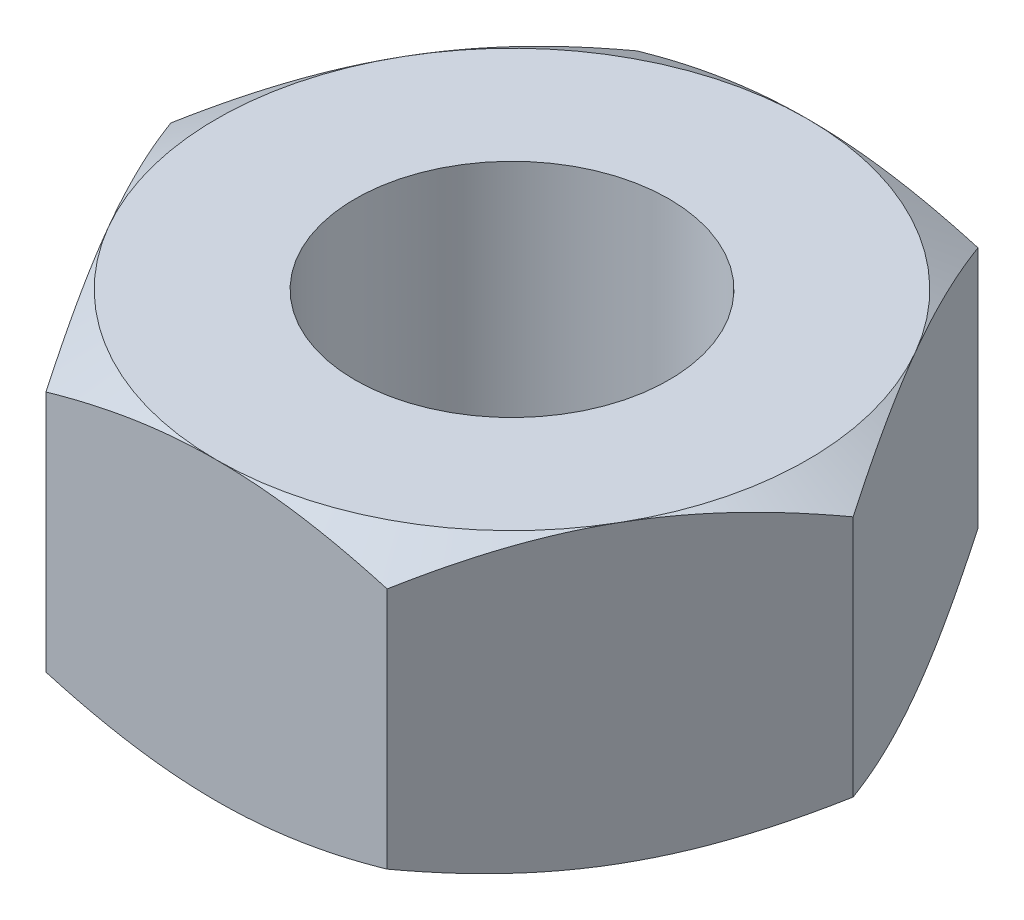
from build123d import *

# Parameters (mm, degrees)
BOSS_EXTRUDE1_DEPTH    = 8
M10X1_5_TAPPED_HOLE1_D = 8.5
SKETCH5_OUTSIDE_W      = 49.868
SKETCH5_OUTSIDE_H      = 47.392
SKETCH5_OUTSIDE_R      = 8
CUT_EXTRUDE1_DEPTH     = 7
CUT_EXTRUDE1_DRAFT     = -60
SKETCH6_OUTSIDE_W      = 49.868
SKETCH6_OUTSIDE_H      = 47.392
SKETCH6_OUTSIDE_R      = 8
CUT_EXTRUDE2_DEPTH     = 7
CUT_EXTRUDE2_DRAFT     = -60


with BuildPart() as part:
    # Sketch1 → Boss-Extrude1 (new body)
    with BuildSketch(Plane(origin=(0, 0, 0), x_dir=(1, 0, 0), z_dir=(0, 1, 0))):
        Polygon((9.237604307, 0), (4.618802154, 8), (-4.618802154, 8), (-9.237604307, 0), (-4.618802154, -8), (4.618802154, -8), align=None)
    extrude(amount=BOSS_EXTRUDE1_DEPTH)

    # M10x1.5 Tapped Hole1 (through all)
    with Locations(Plane(origin=(0, 8, 0), x_dir=(1, 0, 0), z_dir=(0, 1, 0))):
        with Locations((0, 0)):
            Hole(M10X1_5_TAPPED_HOLE1_D / 2)


with BuildPart() as cut_extrude1_tool:
    # Sketch5 outside → Cut-Extrude1 (with draft: the straight prism first)
    with BuildSketch(Plane(origin=(0, 8, 0), x_dir=(1, 0, 0), z_dir=(0, 1, 0))):
        Rectangle(SKETCH5_OUTSIDE_W, SKETCH5_OUTSIDE_H)
        Circle(SKETCH5_OUTSIDE_R, mode=Mode.SUBTRACT)
    extrude(amount=-CUT_EXTRUDE1_DEPTH)
    # Cut-Extrude1: the draft: its side faces are tilted about the plane it starts from
    cut_extrude1_sides = [cut_extrude1_tool.faces().sort_by_distance(p)[0] for p in [
        (0, 4.5, 23.696),
        (24.934, 4.5, 0),
        (0, 4.5, -23.696),
        (-24.934, 4.5, 0),
        (-8, 4.5, 0),
    ]]
    draft(cut_extrude1_sides, Plane(origin=(0, 8, 0), x_dir=(1, 0, 0), z_dir=(0, 1, 0)), CUT_EXTRUDE1_DRAFT)


with BuildPart() as part_1:
    add(part.part)

    # Cut-Extrude1: cut by cut_extrude1_tool
    add(cut_extrude1_tool.part, mode=Mode.SUBTRACT)


with BuildPart() as cut_extrude2_tool:
    # Sketch6 outside → Cut-Extrude2 (with draft: the straight prism first)
    with BuildSketch(Plane.XZ):
        Rectangle(SKETCH6_OUTSIDE_W, SKETCH6_OUTSIDE_H)
        Circle(SKETCH6_OUTSIDE_R, mode=Mode.SUBTRACT)
    extrude(amount=-CUT_EXTRUDE2_DEPTH)
    # Cut-Extrude2: the draft: its side faces are tilted about the plane it starts from
    cut_extrude2_sides = [cut_extrude2_tool.faces().sort_by_distance(p)[0] for p in [
        (0, 3.5, -23.696),
        (24.934, 3.5, 0),
        (0, 3.5, 23.696),
        (-24.934, 3.5, 0),
        (-8, 3.5, 0),
    ]]
    draft(cut_extrude2_sides, Plane.XZ, CUT_EXTRUDE2_DRAFT)


with BuildPart() as part_2:
    add(part_1.part)

    # Cut-Extrude2: cut by cut_extrude2_tool
    add(cut_extrude2_tool.part, mode=Mode.SUBTRACT)


solid = part_2.part
